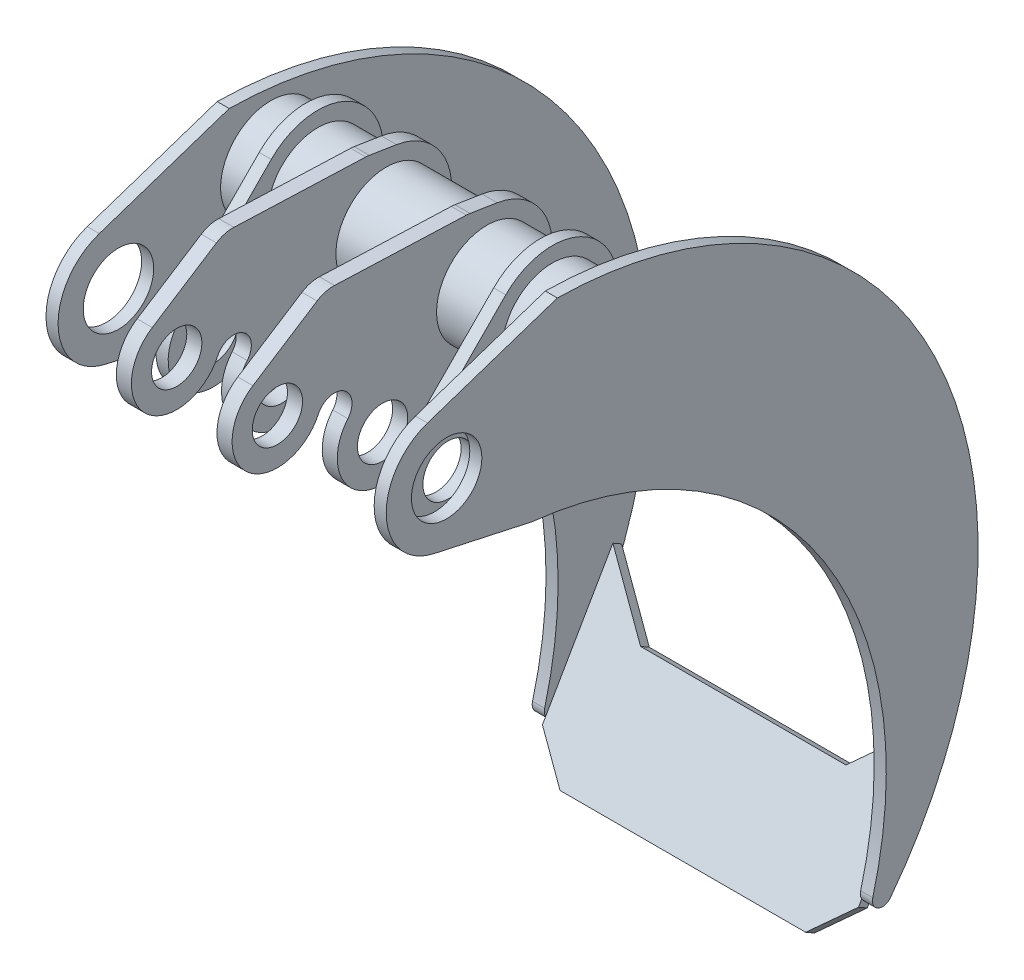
from build123d import *

# Parameters (mm, degrees)
SKIZZE1_R                            = 35
AUFSATZ_LINEAR_AUSTRAGEN1_DEPTH      = 12
AUFSATZ_LINEAR_AUSTRAGEN2_DEPTH      = 314
SKIZZE3_R                            = 35
AUFSATZ_LINEAR_AUSTRAGEN3_DEPTH      = 12
FASE1_SIZE                           = 35
SCHNITT_LINEAR_AUSTRAGEN1_DEPTH      = 843.432958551
SCHNITT_LINEAR_AUSTRAGEN1_DEPTH_BACK = 10
AUFSATZ_LINEAR_AUSTRAGEN8_REACH      = 879.924
SKIZZE6_R                            = 50
SKIZZE6_R_2                          = 42
AUFSATZ_LINEAR_START                 = -15
SKIZZE8_R                            = 50
SKIZZE8_R_2                          = 25
AUFSATZ_LINEAR_AUSTRAGEN9_DEPTH      = 15
AUFSATZ_LINEAR_START_2               = 12
SKIZZE9_R                            = 50
SKIZZE9_R_2                          = 25
AUFSATZ_LINEAR_AUSTRAGEN10_DEPTH     = 12


with BuildPart() as part:
    # Skizze1 → Aufsatz-Linear austragen1 (new body)
    with BuildSketch(Plane(origin=(0, 0, 0), x_dir=(0, 0, -1), z_dir=(1, 0, 0))):
        with BuildLine():
            Line((-19.008517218, 56.90936894), (110, 100))
            ThreePointArc((110, 100), (485.375130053, -138.700576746), (440.947142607, -581.318479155))
            ThreePointArc((440.947142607, -581.318479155), (428.585840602, -584.221667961), (423.341500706, -572.657620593))
            ThreePointArc((423.341500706, -572.657620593), (367.72161733, -248.345705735), (85, -80))
            Line((85, -80), (-12.81465141, -58.615567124))
            ThreePointArc((-12.81465141, -58.615567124), (-59.913948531, -3.212284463), (-19.008517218, 56.90936894))
        make_face()
        Circle(SKIZZE1_R, mode=Mode.SUBTRACT)
    extrude(amount=AUFSATZ_LINEAR_AUSTRAGEN1_DEPTH)

    # Skizze2 → Aufsatz-Linear austragen2 (add)
    with BuildSketch(Plane(origin=(12, 0, 0), x_dir=(0, 0, -1), z_dir=(1, 0, 0))):
        Polygon((412.330127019, -621.049912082), (499.830127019, -469.49546642), (491.169872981, -464.49546642), (403.669872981, -616.049912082), align=None)
    extrude(amount=AUFSATZ_LINEAR_AUSTRAGEN2_DEPTH)

    # Skizze3 → Aufsatz-Linear austragen3 (add)
    with BuildSketch(Plane(origin=(326, 0, 0), x_dir=(0, 0, -1), z_dir=(1, 0, 0))):
        with BuildLine():
            Line((110, 100), (-19.008517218, 56.90936894))
            ThreePointArc((-19.008517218, 56.90936894), (-59.913948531, -3.212284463), (-12.81465141, -58.615567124))
            Line((-12.81465141, -58.615567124), (85, -80))
            ThreePointArc((85, -80), (367.72161733, -248.345705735), (423.341500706, -572.657620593))
            ThreePointArc((423.341500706, -572.657620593), (428.585840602, -584.221667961), (440.947142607, -581.318479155))
            ThreePointArc((440.947142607, -581.318479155), (485.375130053, -138.700576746), (110, 100))
        make_face()
        Circle(SKIZZE3_R, mode=Mode.SUBTRACT)
    extrude(amount=AUFSATZ_LINEAR_AUSTRAGEN3_DEPTH)

    # Fase1
    fase1_edges = [part.edges().sort_by_distance(p)[0] for p in [
        (12, -618.549912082, -408),
        (326, -618.549912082, -408),
    ]]
    chamfer(fase1_edges, length=FASE1_SIZE)

    # Skizze4 → Schnitt-Linear austragen1 (cut, two sides: drawn at the far end of the back side and taken through both)
    with BuildSketch(Plane(origin=(0, -333.806660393, -578.170095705), x_dir=(-1, 0, 0), z_dir=(0, -0.49999999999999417, -0.866025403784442)).offset(-SCHNITT_LINEAR_AUSTRAGEN1_DEPTH_BACK)):
        Polygon((-271, -211.679937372), (-67, -211.679937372), (-12, -156.679937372), (-326, -156.679937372), align=None)
    extrude(amount=SCHNITT_LINEAR_AUSTRAGEN1_DEPTH + SCHNITT_LINEAR_AUSTRAGEN1_DEPTH_BACK, mode=Mode.SUBTRACT)

    # Skizze6 → Aufsatz-Linear austragen8 (add, up to next)
    with BuildSketch(Plane(origin=(12, 0, 0), x_dir=(0, 0, -1), z_dir=(1, 0, 0)), mode=Mode.PRIVATE) as aufsatz_linear_austragen8_sk1:
        with Locations((151.484516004, 36.129613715)):
            Circle(SKIZZE6_R)
        with Locations((151.484516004, 36.129613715)):
            Circle(SKIZZE6_R_2, mode=Mode.SUBTRACT)
    aufsatz_linear_austragen8_tool1 = extrude(aufsatz_linear_austragen8_sk1.sketch, amount=AUFSATZ_LINEAR_AUSTRAGEN8_REACH, mode=Mode.PRIVATE) - part.part
    add(aufsatz_linear_austragen8_tool1.solids().sort_by_distance((12, 36.129614, -102.89873))[0])

    # Skizze8 → Aufsatz-Linear austragen9 (add)
    with BuildSketch(Plane(origin=(226.5, 0, 0), x_dir=(0, 0, -1), z_dir=(1, 0, 0)).offset(AUFSATZ_LINEAR_START)):
        with BuildLine():
            Line((161.725380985, 100.317811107), (134.726553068, 104.625321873))
            ThreePointArc((134.726553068, 104.625321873), (132.939964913, 104.855595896), (131.142776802, 104.978226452))
            Line((131.142776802, 104.978226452), (0.142776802, 109.971976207))
            ThreePointArc((0.142776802, 109.971976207), (-8.900364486, 108.934797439), (-17.216196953, 105.233301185))
            Line((-17.216196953, 105.233301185), (-80.96853212, 64.272968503))
            ThreePointArc((-80.96853212, 64.272968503), (-86.249671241, -7.47615423), (-15.860386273, 7.39581958))
            ThreePointArc((-15.860386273, 7.39581958), (9.402743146, 14.759350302), (13.405777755, -11.24878317))
            ThreePointArc((13.405777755, -11.24878317), (12.765485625, -68.318975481), (68.606858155, -80.115497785))
            Line((68.606858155, -80.115497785), (181.426521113, -21.563334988))
            ThreePointArc((181.426521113, -21.563334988), (215.651635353, 46.501729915), (161.725380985, 100.317811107))
        make_face()
        with Locations(Location((151.484516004, 36.129613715, 0), (0, 0, 180))):
            Circle(SKIZZE8_R, mode=Mode.SUBTRACT)
        with Locations((-56.64423669, 26.413641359)):
            Circle(SKIZZE8_R_2, mode=Mode.SUBTRACT)
        with Locations((47.877777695, -40.174225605)):
            Circle(SKIZZE8_R_2, mode=Mode.SUBTRACT)
    aufsatz_linear_austragen9 = extrude(amount=AUFSATZ_LINEAR_AUSTRAGEN9_DEPTH)

    # Skizze9 → Aufsatz-Linear austragen10 (add)
    with BuildSketch(Plane.ZY.offset(-291.5).offset(AUFSATZ_LINEAR_START_2)):
        with BuildLine():
            Line((-105.272443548, 81.84005409), (-15.884804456, -8.528536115))
            ThreePointArc((-15.884804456, -8.528536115), (-11.643924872, -66.859575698), (-68.606858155, -80.115497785))
            Line((-68.606858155, -80.115497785), (-181.426521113, -21.563334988))
            ThreePointArc((-181.426521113, -21.563334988), (-203.822303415, 74.675119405), (-105.272443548, 81.84005409))
        make_face()
        with Locations((-151.484516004, 36.129613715)):
            Circle(SKIZZE9_R, mode=Mode.SUBTRACT)
        with Locations(Location((-47.877777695, -40.174225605, 0), (0, 0, 180))):
            Circle(SKIZZE9_R_2, mode=Mode.SUBTRACT)
    aufsatz_linear_austragen10 = extrude(amount=-AUFSATZ_LINEAR_AUSTRAGEN10_DEPTH)

    # Spiegeln1: Aufsatz-Linear austragen9, Aufsatz-Linear austragen10 across plane
    add(aufsatz_linear_austragen9.mirror(Plane(origin=(169, 0, 0), x_dir=(0, 0, 1), z_dir=(1, 0, 0))))
    add(aufsatz_linear_austragen10.mirror(Plane(origin=(169, 0, 0), x_dir=(0, 0, 1), z_dir=(1, 0, 0))))


solid = part.part
